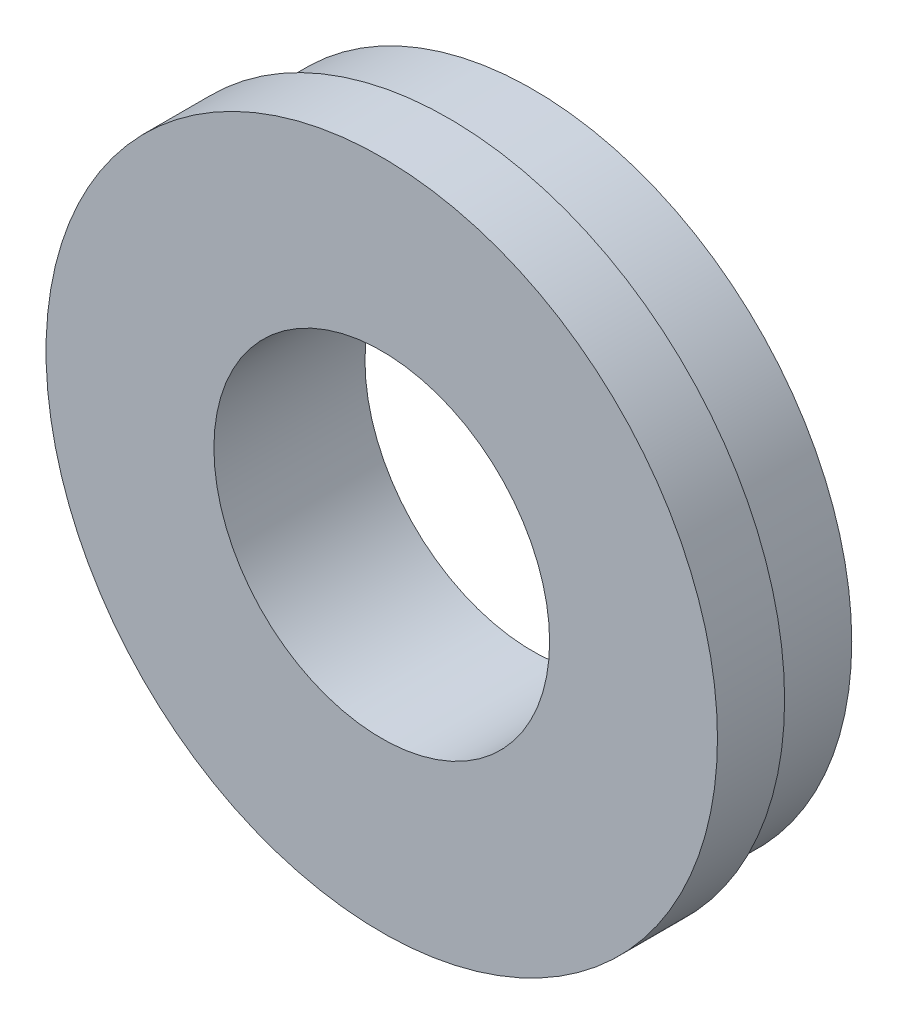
ISO-10303-21;
HEADER;
FILE_DESCRIPTION(('STEP AP214'),'2;1');
FILE_NAME('part.step','',(''),(''),'','','');
FILE_SCHEMA(('AUTOMOTIVE_DESIGN { 1 0 10303 214 1 1 1 1 }'));
ENDSEC;
DATA;
#1=APPLICATION_CONTEXT('core data for automotive mechanical design processes');
#2=APPLICATION_PROTOCOL_DEFINITION('international standard','automotive_design',2000,#1);
#3=PRODUCT_CONTEXT('',#1,'mechanical');
#4=PRODUCT('Part','Part','',(#3));
#5=PRODUCT_RELATED_PRODUCT_CATEGORY('part','',(#4));
#6=PRODUCT_DEFINITION_FORMATION('','',#4);
#7=PRODUCT_DEFINITION_CONTEXT('part definition',#1,'design');
#8=PRODUCT_DEFINITION('design','',#6,#7);
#9=PRODUCT_DEFINITION_SHAPE('','',#8);
#10=(LENGTH_UNIT() NAMED_UNIT(*) SI_UNIT(.MILLI.,.METRE.));
#11=(NAMED_UNIT(*) PLANE_ANGLE_UNIT() SI_UNIT($,.RADIAN.));
#12=(NAMED_UNIT(*) SI_UNIT($,.STERADIAN.) SOLID_ANGLE_UNIT());
#13=UNCERTAINTY_MEASURE_WITH_UNIT(LENGTH_MEASURE(1.E-05),#10,'distance_accuracy_value','');
#14=(GEOMETRIC_REPRESENTATION_CONTEXT(3) GLOBAL_UNCERTAINTY_ASSIGNED_CONTEXT((#13)) GLOBAL_UNIT_ASSIGNED_CONTEXT((#10,
#11,#12)) REPRESENTATION_CONTEXT('',''));
#15=CARTESIAN_POINT('',(0.,0.,0.));
#16=DIRECTION('',(0.,0.,1.));
#17=DIRECTION('',(1.,0.,0.));
#18=AXIS2_PLACEMENT_3D('',#15,#16,#17);
#19=CARTESIAN_POINT('',(0.,0.,0.));
#20=DIRECTION('',(0.,0.,-1.));
#21=DIRECTION('',(-1.,0.,0.));
#22=AXIS2_PLACEMENT_3D('',#19,#20,#21);
#23=PLANE('',#22);
#24=CARTESIAN_POINT('',(0.,0.,0.));
#25=DIRECTION('',(0.,0.,1.));
#26=DIRECTION('',(1.,0.,0.));
#27=AXIS2_PLACEMENT_3D('',#24,#25,#26);
#28=CIRCLE('',#27,2.);
#29=CARTESIAN_POINT('',(2.,0.,0.));
#30=VERTEX_POINT('',#29);
#31=EDGE_CURVE('E33',#30,#30,#28,.T.);
#32=ORIENTED_EDGE('',*,*,#31,.F.);
#33=EDGE_LOOP('',(#32));
#34=FACE_BOUND('',#33,.T.);
#35=CARTESIAN_POINT('',(0.,0.,0.));
#36=DIRECTION('',(0.,0.,1.));
#37=DIRECTION('',(1.,0.,0.));
#38=AXIS2_PLACEMENT_3D('',#35,#36,#37);
#39=CIRCLE('',#38,4.);
#40=CARTESIAN_POINT('',(4.,0.,0.));
#41=VERTEX_POINT('',#40);
#42=EDGE_CURVE('E10',#41,#41,#39,.T.);
#43=ORIENTED_EDGE('',*,*,#42,.T.);
#44=EDGE_LOOP('',(#43));
#45=FACE_BOUND('',#44,.T.);
#46=ADVANCED_FACE('F14',(#34,#45),#23,.F.);
#47=CARTESIAN_POINT('',(0.,0.,-1.8));
#48=DIRECTION('',(0.,0.,1.));
#49=DIRECTION('',(1.,0.,0.));
#50=AXIS2_PLACEMENT_3D('',#47,#48,#49);
#51=CYLINDRICAL_SURFACE('',#50,4.);
#52=ORIENTED_EDGE('',*,*,#42,.F.);
#53=EDGE_LOOP('',(#52));
#54=FACE_BOUND('',#53,.T.);
#55=CARTESIAN_POINT('',(0.,0.,-0.8));
#56=DIRECTION('',(0.,0.,1.));
#57=DIRECTION('',(1.,0.,0.));
#58=AXIS2_PLACEMENT_3D('',#55,#56,#57);
#59=CIRCLE('',#58,4.);
#60=CARTESIAN_POINT('',(4.,0.,-0.8));
#61=VERTEX_POINT('',#60);
#62=EDGE_CURVE('E20',#61,#61,#59,.T.);
#63=ORIENTED_EDGE('',*,*,#62,.T.);
#64=EDGE_LOOP('',(#63));
#65=FACE_BOUND('',#64,.T.);
#66=ADVANCED_FACE('F55',(#54,#65),#51,.T.);
#67=CARTESIAN_POINT('',(0.,4.,-0.8));
#68=DIRECTION('',(0.,0.,1.));
#69=DIRECTION('',(1.,0.,0.));
#70=AXIS2_PLACEMENT_3D('',#67,#68,#69);
#71=PLANE('',#70);
#72=ORIENTED_EDGE('',*,*,#62,.F.);
#73=EDGE_LOOP('',(#72));
#74=FACE_BOUND('',#73,.T.);
#75=CARTESIAN_POINT('',(0.,0.,-0.8));
#76=DIRECTION('',(0.,0.,1.));
#77=DIRECTION('',(1.,0.,0.));
#78=AXIS2_PLACEMENT_3D('',#75,#76,#77);
#79=CIRCLE('',#78,3.8);
#80=CARTESIAN_POINT('',(3.8,0.,-0.8));
#81=VERTEX_POINT('',#80);
#82=EDGE_CURVE('E24',#81,#81,#79,.T.);
#83=ORIENTED_EDGE('',*,*,#82,.T.);
#84=EDGE_LOOP('',(#83));
#85=FACE_BOUND('',#84,.T.);
#86=ADVANCED_FACE('F61',(#74,#85),#71,.F.);
#87=CARTESIAN_POINT('',(0.,0.,-1.8));
#88=DIRECTION('',(0.,0.,1.));
#89=DIRECTION('',(1.,0.,0.));
#90=AXIS2_PLACEMENT_3D('',#87,#88,#89);
#91=CYLINDRICAL_SURFACE('',#90,3.8);
#92=ORIENTED_EDGE('',*,*,#82,.F.);
#93=EDGE_LOOP('',(#92));
#94=FACE_BOUND('',#93,.T.);
#95=CARTESIAN_POINT('',(0.,0.,-1.8));
#96=DIRECTION('',(0.,0.,1.));
#97=DIRECTION('',(1.,0.,0.));
#98=AXIS2_PLACEMENT_3D('',#95,#96,#97);
#99=CIRCLE('',#98,3.8);
#100=CARTESIAN_POINT('',(3.8,0.,-1.8));
#101=VERTEX_POINT('',#100);
#102=EDGE_CURVE('E28',#101,#101,#99,.T.);
#103=ORIENTED_EDGE('',*,*,#102,.T.);
#104=EDGE_LOOP('',(#103));
#105=FACE_BOUND('',#104,.T.);
#106=ADVANCED_FACE('F52',(#94,#105),#91,.T.);
#107=CARTESIAN_POINT('',(0.,3.8,-1.8));
#108=DIRECTION('',(0.,0.,1.));
#109=DIRECTION('',(1.,0.,0.));
#110=AXIS2_PLACEMENT_3D('',#107,#108,#109);
#111=PLANE('',#110);
#112=CARTESIAN_POINT('',(0.,0.,-1.8));
#113=DIRECTION('',(0.,0.,1.));
#114=DIRECTION('',(1.,0.,0.));
#115=AXIS2_PLACEMENT_3D('',#112,#113,#114);
#116=CIRCLE('',#115,2.);
#117=CARTESIAN_POINT('',(2.,0.,-1.8));
#118=VERTEX_POINT('',#117);
#119=EDGE_CURVE('E36',#118,#118,#116,.T.);
#120=ORIENTED_EDGE('',*,*,#119,.T.);
#121=EDGE_LOOP('',(#120));
#122=FACE_BOUND('',#121,.T.);
#123=ORIENTED_EDGE('',*,*,#102,.F.);
#124=EDGE_LOOP('',(#123));
#125=FACE_BOUND('',#124,.T.);
#126=ADVANCED_FACE('F40',(#122,#125),#111,.F.);
#127=CARTESIAN_POINT('',(0.,0.,-1.8));
#128=DIRECTION('',(0.,0.,1.));
#129=DIRECTION('',(1.,0.,0.));
#130=AXIS2_PLACEMENT_3D('',#127,#128,#129);
#131=CYLINDRICAL_SURFACE('',#130,2.);
#132=ORIENTED_EDGE('',*,*,#31,.T.);
#133=EDGE_LOOP('',(#132));
#134=FACE_BOUND('',#133,.T.);
#135=ORIENTED_EDGE('',*,*,#119,.F.);
#136=EDGE_LOOP('',(#135));
#137=FACE_BOUND('',#136,.T.);
#138=ADVANCED_FACE('F43',(#134,#137),#131,.F.);
#139=CLOSED_SHELL('',(#46,#66,#86,#106,#126,#138));
#140=MANIFOLD_SOLID_BREP('B1',#139);
#141=ADVANCED_BREP_SHAPE_REPRESENTATION('',(#18,#140),#14);
#142=SHAPE_DEFINITION_REPRESENTATION(#9,#141);
ENDSEC;
END-ISO-10303-21;
